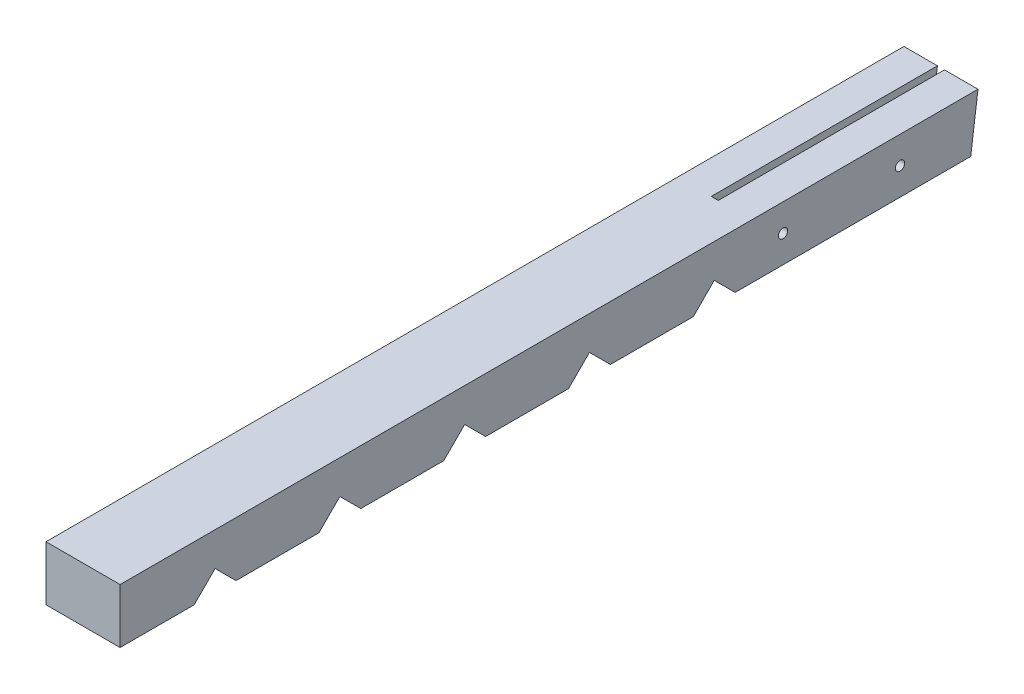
ISO-10303-21;
HEADER;
FILE_DESCRIPTION(('STEP AP214'),'2;1');
FILE_NAME('part.step','',(''),(''),'','','');
FILE_SCHEMA(('AUTOMOTIVE_DESIGN { 1 0 10303 214 1 1 1 1 }'));
ENDSEC;
DATA;
#1=APPLICATION_CONTEXT('core data for automotive mechanical design processes');
#2=APPLICATION_PROTOCOL_DEFINITION('international standard','automotive_design',2000,#1);
#3=PRODUCT_CONTEXT('',#1,'mechanical');
#4=PRODUCT('Part','Part','',(#3));
#5=PRODUCT_RELATED_PRODUCT_CATEGORY('part','',(#4));
#6=PRODUCT_DEFINITION_FORMATION('','',#4);
#7=PRODUCT_DEFINITION_CONTEXT('part definition',#1,'design');
#8=PRODUCT_DEFINITION('design','',#6,#7);
#9=PRODUCT_DEFINITION_SHAPE('','',#8);
#10=(LENGTH_UNIT() NAMED_UNIT(*) SI_UNIT(.MILLI.,.METRE.));
#11=(NAMED_UNIT(*) PLANE_ANGLE_UNIT() SI_UNIT($,.RADIAN.));
#12=(NAMED_UNIT(*) SI_UNIT($,.STERADIAN.) SOLID_ANGLE_UNIT());
#13=UNCERTAINTY_MEASURE_WITH_UNIT(LENGTH_MEASURE(1.E-05),#10,'distance_accuracy_value','');
#14=(GEOMETRIC_REPRESENTATION_CONTEXT(3) GLOBAL_UNCERTAINTY_ASSIGNED_CONTEXT((#13)) GLOBAL_UNIT_ASSIGNED_CONTEXT((#10,
#11,#12)) REPRESENTATION_CONTEXT('',''));
#15=CARTESIAN_POINT('',(0.,0.,0.));
#16=DIRECTION('',(0.,0.,1.));
#17=DIRECTION('',(1.,0.,0.));
#18=AXIS2_PLACEMENT_3D('',#15,#16,#17);
#19=CARTESIAN_POINT('',(-47.5,5.,1100.));
#20=DIRECTION('',(0.,1.,0.));
#21=DIRECTION('',(-1.,0.,0.));
#22=AXIS2_PLACEMENT_3D('',#19,#20,#21);
#23=PLANE('',#22);
#24=DIRECTION('',(0.,0.,-1.));
#25=VECTOR('',#24,1.);
#26=CARTESIAN_POINT('',(-47.5,5.,1100.));
#27=LINE('',#26,#25);
#28=CARTESIAN_POINT('',(-47.5,5.,311.360389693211));
#29=VERTEX_POINT('',#28);
#30=CARTESIAN_POINT('',(-47.5,5.,9.33333333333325));
#31=VERTEX_POINT('',#30);
#32=EDGE_CURVE('E362',#29,#31,#27,.T.);
#33=ORIENTED_EDGE('',*,*,#32,.T.);
#34=DIRECTION('',(1.,0.,0.));
#35=VECTOR('',#34,1.);
#36=CARTESIAN_POINT('',(-47.5,5.,9.33333333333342));
#37=LINE('',#36,#35);
#38=CARTESIAN_POINT('',(-4.5,4.99999999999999,9.33333333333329));
#39=VERTEX_POINT('',#38);
#40=EDGE_CURVE('E210',#31,#39,#37,.T.);
#41=ORIENTED_EDGE('',*,*,#40,.T.);
#42=DIRECTION('',(0.,0.,-1.));
#43=VECTOR('',#42,1.);
#44=CARTESIAN_POINT('',(-4.5,5.,1100.));
#45=LINE('',#44,#43);
#46=CARTESIAN_POINT('',(-4.5,5.,290.));
#47=VERTEX_POINT('',#46);
#48=EDGE_CURVE('E238',#47,#39,#45,.T.);
#49=ORIENTED_EDGE('',*,*,#48,.F.);
#50=DIRECTION('',(1.,0.,0.));
#51=VECTOR('',#50,1.);
#52=CARTESIAN_POINT('',(-47.5,5.,290.));
#53=LINE('',#52,#51);
#54=CARTESIAN_POINT('',(4.5,5.,290.));
#55=VERTEX_POINT('',#54);
#56=EDGE_CURVE('E240',#47,#55,#53,.T.);
#57=ORIENTED_EDGE('',*,*,#56,.T.);
#58=DIRECTION('',(0.,0.,1.));
#59=VECTOR('',#58,1.);
#60=CARTESIAN_POINT('',(4.5,5.,1100.));
#61=LINE('',#60,#59);
#62=CARTESIAN_POINT('',(4.5,5.00000000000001,9.33333333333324));
#63=VERTEX_POINT('',#62);
#64=EDGE_CURVE('E232',#63,#55,#61,.T.);
#65=ORIENTED_EDGE('',*,*,#64,.F.);
#66=CARTESIAN_POINT('',(47.5,5.00000000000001,9.33333333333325));
#67=VERTEX_POINT('',#66);
#68=EDGE_CURVE('E41',#63,#67,#37,.T.);
#69=ORIENTED_EDGE('',*,*,#68,.T.);
#70=DIRECTION('',(0.,0.,-1.));
#71=VECTOR('',#70,1.);
#72=CARTESIAN_POINT('',(47.5,5.00000000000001,1100.));
#73=LINE('',#72,#71);
#74=CARTESIAN_POINT('',(47.5,5.00000000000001,311.360389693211));
#75=VERTEX_POINT('',#74);
#76=EDGE_CURVE('E358',#75,#67,#73,.T.);
#77=ORIENTED_EDGE('',*,*,#76,.F.);
#78=DIRECTION('',(-1.,0.,0.));
#79=VECTOR('',#78,1.);
#80=CARTESIAN_POINT('',(47.501,5.00000000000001,311.360389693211));
#81=LINE('',#80,#79);
#82=EDGE_CURVE('E263',#75,#29,#81,.T.);
#83=ORIENTED_EDGE('',*,*,#82,.T.);
#84=EDGE_LOOP('',(#33,#41,#49,#57,#65,#69,#77,#83));
#85=FACE_BOUND('',#84,.T.);
#86=ADVANCED_FACE('F26',(#85),#23,.F.);
#87=CARTESIAN_POINT('',(47.5,75.,1100.));
#88=DIRECTION('',(0.,-1.,0.));
#89=DIRECTION('',(1.,0.,0.));
#90=AXIS2_PLACEMENT_3D('',#87,#88,#89);
#91=PLANE('',#90);
#92=DIRECTION('',(0.,0.,-1.));
#93=VECTOR('',#92,1.);
#94=CARTESIAN_POINT('',(-4.5,75.,290.));
#95=LINE('',#94,#93);
#96=CARTESIAN_POINT('',(-4.5,75.,290.));
#97=VERTEX_POINT('',#96);
#98=CARTESIAN_POINT('',(-4.5,75.,0.));
#99=VERTEX_POINT('',#98);
#100=EDGE_CURVE('E205',#97,#99,#95,.T.);
#101=ORIENTED_EDGE('',*,*,#100,.T.);
#102=DIRECTION('',(-1.,0.,0.));
#103=VECTOR('',#102,1.);
#104=CARTESIAN_POINT('',(47.5,75.,0.));
#105=LINE('',#104,#103);
#106=CARTESIAN_POINT('',(-47.5,75.,0.));
#107=VERTEX_POINT('',#106);
#108=EDGE_CURVE('E196',#99,#107,#105,.T.);
#109=ORIENTED_EDGE('',*,*,#108,.T.);
#110=DIRECTION('',(0.,0.,-1.));
#111=VECTOR('',#110,1.);
#112=CARTESIAN_POINT('',(-47.5,75.,1100.));
#113=LINE('',#112,#111);
#114=CARTESIAN_POINT('',(-47.5,75.,1100.));
#115=VERTEX_POINT('',#114);
#116=EDGE_CURVE('E367',#115,#107,#113,.T.);
#117=ORIENTED_EDGE('',*,*,#116,.F.);
#118=DIRECTION('',(-1.,0.,0.));
#119=VECTOR('',#118,1.);
#120=CARTESIAN_POINT('',(47.5,75.,1100.));
#121=LINE('',#120,#119);
#122=CARTESIAN_POINT('',(47.5,75.,1100.));
#123=VERTEX_POINT('',#122);
#124=EDGE_CURVE('E352',#123,#115,#121,.T.);
#125=ORIENTED_EDGE('',*,*,#124,.F.);
#126=DIRECTION('',(0.,0.,-1.));
#127=VECTOR('',#126,1.);
#128=CARTESIAN_POINT('',(47.5,75.,1100.));
#129=LINE('',#128,#127);
#130=CARTESIAN_POINT('',(47.5,75.,0.));
#131=VERTEX_POINT('',#130);
#132=EDGE_CURVE('E34',#123,#131,#129,.T.);
#133=ORIENTED_EDGE('',*,*,#132,.T.);
#134=CARTESIAN_POINT('',(4.49999999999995,75.,0.));
#135=VERTEX_POINT('',#134);
#136=EDGE_CURVE('E186',#131,#135,#105,.T.);
#137=ORIENTED_EDGE('',*,*,#136,.T.);
#138=DIRECTION('',(0.,0.,-1.));
#139=VECTOR('',#138,1.);
#140=CARTESIAN_POINT('',(4.5,75.,290.));
#141=LINE('',#140,#139);
#142=CARTESIAN_POINT('',(4.5,75.,290.));
#143=VERTEX_POINT('',#142);
#144=EDGE_CURVE('E191',#143,#135,#141,.T.);
#145=ORIENTED_EDGE('',*,*,#144,.F.);
#146=DIRECTION('',(-1.,0.,0.));
#147=VECTOR('',#146,1.);
#148=CARTESIAN_POINT('',(4.5,75.,290.));
#149=LINE('',#148,#147);
#150=EDGE_CURVE('E226',#143,#97,#149,.T.);
#151=ORIENTED_EDGE('',*,*,#150,.T.);
#152=EDGE_LOOP('',(#101,#109,#117,#125,#133,#137,#145,#151));
#153=FACE_BOUND('',#152,.T.);
#154=ADVANCED_FACE('F189',(#153),#91,.F.);
#155=CARTESIAN_POINT('',(47.5,40.,250.));
#156=DIRECTION('',(-1.,0.,0.));
#157=DIRECTION('',(0.,0.,1.));
#158=AXIS2_PLACEMENT_3D('',#155,#156,#157);
#159=CYLINDRICAL_SURFACE('',#158,6.00000000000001);
#160=CARTESIAN_POINT('',(-47.5,40.,250.));
#161=DIRECTION('',(1.,0.,0.));
#162=DIRECTION('',(0.,0.,-1.));
#163=AXIS2_PLACEMENT_3D('',#160,#161,#162);
#164=CIRCLE('',#163,6.00000000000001);
#165=CARTESIAN_POINT('',(-47.5,40.,256.));
#166=VERTEX_POINT('',#165);
#167=EDGE_CURVE('E249',#166,#166,#164,.T.);
#168=CARTESIAN_POINT('',(-4.5,40.,250.));
#169=DIRECTION('',(1.,0.,0.));
#170=DIRECTION('',(0.,0.,-1.));
#171=AXIS2_PLACEMENT_3D('',#168,#169,#170);
#172=CIRCLE('',#171,6.00000000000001);
#173=CARTESIAN_POINT('',(-4.5,40.,256.));
#174=VERTEX_POINT('',#173);
#175=EDGE_CURVE('E235',#174,#174,#172,.T.);
#176=CARTESIAN_POINT('',(-47.5,40.,256.));
#177=CARTESIAN_POINT('',(-47.0520833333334,40.,256.));
#178=CARTESIAN_POINT('',(-46.6041666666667,40.,256.));
#179=CARTESIAN_POINT('',(-45.7083333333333,40.,256.));
#180=CARTESIAN_POINT('',(-45.2604166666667,40.,256.));
#181=CARTESIAN_POINT('',(-44.3645833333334,40.,256.));
#182=CARTESIAN_POINT('',(-43.9166666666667,40.,256.));
#183=CARTESIAN_POINT('',(-43.0208333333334,40.,256.));
#184=CARTESIAN_POINT('',(-42.5729166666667,40.,256.));
#185=CARTESIAN_POINT('',(-41.6770833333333,40.,256.));
#186=CARTESIAN_POINT('',(-41.2291666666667,40.,256.));
#187=CARTESIAN_POINT('',(-40.3333333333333,40.,256.));
#188=CARTESIAN_POINT('',(-39.8854166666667,40.,256.));
#189=CARTESIAN_POINT('',(-38.9895833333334,40.,256.));
#190=CARTESIAN_POINT('',(-38.5416666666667,40.,256.));
#191=CARTESIAN_POINT('',(-37.6458333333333,40.,256.));
#192=CARTESIAN_POINT('',(-37.1979166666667,40.,256.));
#193=CARTESIAN_POINT('',(-36.3020833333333,40.,256.));
#194=CARTESIAN_POINT('',(-35.8541666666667,40.,256.));
#195=CARTESIAN_POINT('',(-34.9583333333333,40.,256.));
#196=CARTESIAN_POINT('',(-34.5104166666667,40.,256.));
#197=CARTESIAN_POINT('',(-33.6145833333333,40.,256.));
#198=CARTESIAN_POINT('',(-33.1666666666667,40.,256.));
#199=CARTESIAN_POINT('',(-32.2708333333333,40.,256.));
#200=CARTESIAN_POINT('',(-31.8229166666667,40.,256.));
#201=CARTESIAN_POINT('',(-30.9270833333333,40.,256.));
#202=CARTESIAN_POINT('',(-30.4791666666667,40.,256.));
#203=CARTESIAN_POINT('',(-29.5833333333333,40.,256.));
#204=CARTESIAN_POINT('',(-29.1354166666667,40.,256.));
#205=CARTESIAN_POINT('',(-28.2395833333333,40.,256.));
#206=CARTESIAN_POINT('',(-27.7916666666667,40.,256.));
#207=CARTESIAN_POINT('',(-26.8958333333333,40.,256.));
#208=CARTESIAN_POINT('',(-26.4479166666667,40.,256.));
#209=CARTESIAN_POINT('',(-25.5520833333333,40.,256.));
#210=CARTESIAN_POINT('',(-25.1041666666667,40.,256.));
#211=CARTESIAN_POINT('',(-24.2083333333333,40.,256.));
#212=CARTESIAN_POINT('',(-23.7604166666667,40.,256.));
#213=CARTESIAN_POINT('',(-22.8645833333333,40.,256.));
#214=CARTESIAN_POINT('',(-22.4166666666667,40.,256.));
#215=CARTESIAN_POINT('',(-21.5208333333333,40.,256.));
#216=CARTESIAN_POINT('',(-21.0729166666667,40.,256.));
#217=CARTESIAN_POINT('',(-20.1770833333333,40.,256.));
#218=CARTESIAN_POINT('',(-19.7291666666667,40.,256.));
#219=CARTESIAN_POINT('',(-18.8333333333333,40.,256.));
#220=CARTESIAN_POINT('',(-18.3854166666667,40.,256.));
#221=CARTESIAN_POINT('',(-17.4895833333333,40.,256.));
#222=CARTESIAN_POINT('',(-17.0416666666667,40.,256.));
#223=CARTESIAN_POINT('',(-16.1458333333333,40.,256.));
#224=CARTESIAN_POINT('',(-15.6979166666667,40.,256.));
#225=CARTESIAN_POINT('',(-14.8020833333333,40.,256.));
#226=CARTESIAN_POINT('',(-14.3541666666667,40.,256.));
#227=CARTESIAN_POINT('',(-13.4583333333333,40.,256.));
#228=CARTESIAN_POINT('',(-13.0104166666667,40.,256.));
#229=CARTESIAN_POINT('',(-12.1145833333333,40.,256.));
#230=CARTESIAN_POINT('',(-11.6666666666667,40.,256.));
#231=CARTESIAN_POINT('',(-10.7708333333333,40.,256.));
#232=CARTESIAN_POINT('',(-10.3229166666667,40.,256.));
#233=CARTESIAN_POINT('',(-9.42708333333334,40.,256.));
#234=CARTESIAN_POINT('',(-8.97916666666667,40.,256.));
#235=CARTESIAN_POINT('',(-8.08333333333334,40.,256.));
#236=CARTESIAN_POINT('',(-7.63541666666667,40.,256.));
#237=CARTESIAN_POINT('',(-6.73958333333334,40.,256.));
#238=CARTESIAN_POINT('',(-6.29166666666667,40.,256.));
#239=CARTESIAN_POINT('',(-5.39583333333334,40.,256.));
#240=CARTESIAN_POINT('',(-4.94791666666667,40.,256.));
#241=CARTESIAN_POINT('',(-4.5,40.,256.));
#242=B_SPLINE_CURVE_WITH_KNOTS('',3,(#176,#177,#178,#179,#180,#181,#182,#183,#184,#185,#186,
#187,#188,#189,#190,#191,#192,#193,#194,#195,#196,#197,#198,#199,#200,#201,#202,#203,#204,#205,
#206,#207,#208,#209,#210,#211,#212,#213,#214,#215,#216,#217,#218,#219,#220,#221,#222,#223,#224,
#225,#226,#227,#228,#229,#230,#231,#232,#233,#234,#235,#236,#237,#238,#239,#240,#241),
.UNSPECIFIED.,.F.,.F.,(4,2,2,2,2,2,2,2,2,2,2,2,2,2,2,2,2,2,2,2,2,2,2,2,2,2,2,2,2,2,2,2,4),(0.,
1.34375,2.6875,4.03125,5.375,6.71875000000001,8.0625,9.40625000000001,10.75,12.09375,13.4375,
14.78125,16.125,17.46875,18.8125,20.15625,21.5,22.84375,24.1875,25.53125,26.875,28.21875,
29.5625,30.90625,32.25,33.59375,34.9375,36.28125,37.625,38.96875,40.3125,41.65625,43.),.UNSPECIFIED.);
#243=EDGE_CURVE('BSEAM385',#166,#174,#242,.T.);
#244=ORIENTED_EDGE('',*,*,#167,.F.);
#245=ORIENTED_EDGE('',*,*,#175,.T.);
#246=ORIENTED_EDGE('',*,*,#243,.T.);
#247=ORIENTED_EDGE('',*,*,#243,.F.);
#248=EDGE_LOOP('',(#244,#246,#245,#247));
#249=FACE_BOUND('',#248,.T.);
#250=ADVANCED_FACE('F385',(#249),#159,.F.);
#251=CARTESIAN_POINT('',(47.5,40.,250.));
#252=DIRECTION('',(1.,0.,0.));
#253=DIRECTION('',(0.,0.,-1.));
#254=AXIS2_PLACEMENT_3D('',#251,#252,#253);
#255=CIRCLE('',#254,6.00000000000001);
#256=CARTESIAN_POINT('',(47.5,40.,256.));
#257=VERTEX_POINT('',#256);
#258=EDGE_CURVE('E252',#257,#257,#255,.T.);
#259=CARTESIAN_POINT('',(4.5,40.,250.));
#260=DIRECTION('',(-1.,0.,0.));
#261=DIRECTION('',(0.,0.,1.));
#262=AXIS2_PLACEMENT_3D('',#259,#260,#261);
#263=CIRCLE('',#262,6.00000000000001);
#264=CARTESIAN_POINT('',(4.5,40.,256.));
#265=VERTEX_POINT('',#264);
#266=EDGE_CURVE('E229',#265,#265,#263,.T.);
#267=CARTESIAN_POINT('',(47.5,40.,256.));
#268=CARTESIAN_POINT('',(47.0520833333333,40.,256.));
#269=CARTESIAN_POINT('',(46.6041666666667,40.,256.));
#270=CARTESIAN_POINT('',(45.7083333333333,40.,256.));
#271=CARTESIAN_POINT('',(45.2604166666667,40.,256.));
#272=CARTESIAN_POINT('',(44.3645833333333,40.,256.));
#273=CARTESIAN_POINT('',(43.9166666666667,40.,256.));
#274=CARTESIAN_POINT('',(43.0208333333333,40.,256.));
#275=CARTESIAN_POINT('',(42.5729166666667,40.,256.));
#276=CARTESIAN_POINT('',(41.6770833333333,40.,256.));
#277=CARTESIAN_POINT('',(41.2291666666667,40.,256.));
#278=CARTESIAN_POINT('',(40.3333333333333,40.,256.));
#279=CARTESIAN_POINT('',(39.8854166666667,40.,256.));
#280=CARTESIAN_POINT('',(38.9895833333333,40.,256.));
#281=CARTESIAN_POINT('',(38.5416666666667,40.,256.));
#282=CARTESIAN_POINT('',(37.6458333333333,40.,256.));
#283=CARTESIAN_POINT('',(37.1979166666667,40.,256.));
#284=CARTESIAN_POINT('',(36.3020833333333,40.,256.));
#285=CARTESIAN_POINT('',(35.8541666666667,40.,256.));
#286=CARTESIAN_POINT('',(34.9583333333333,40.,256.));
#287=CARTESIAN_POINT('',(34.5104166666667,40.,256.));
#288=CARTESIAN_POINT('',(33.6145833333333,40.,256.));
#289=CARTESIAN_POINT('',(33.1666666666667,40.,256.));
#290=CARTESIAN_POINT('',(32.2708333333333,40.,256.));
#291=CARTESIAN_POINT('',(31.8229166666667,40.,256.));
#292=CARTESIAN_POINT('',(30.9270833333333,40.,256.));
#293=CARTESIAN_POINT('',(30.4791666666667,40.,256.));
#294=CARTESIAN_POINT('',(29.5833333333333,40.,256.));
#295=CARTESIAN_POINT('',(29.1354166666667,40.,256.));
#296=CARTESIAN_POINT('',(28.2395833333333,40.,256.));
#297=CARTESIAN_POINT('',(27.7916666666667,40.,256.));
#298=CARTESIAN_POINT('',(26.8958333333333,40.,256.));
#299=CARTESIAN_POINT('',(26.4479166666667,40.,256.));
#300=CARTESIAN_POINT('',(25.5520833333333,40.,256.));
#301=CARTESIAN_POINT('',(25.1041666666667,40.,256.));
#302=CARTESIAN_POINT('',(24.2083333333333,40.,256.));
#303=CARTESIAN_POINT('',(23.7604166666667,40.,256.));
#304=CARTESIAN_POINT('',(22.8645833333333,40.,256.));
#305=CARTESIAN_POINT('',(22.4166666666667,40.,256.));
#306=CARTESIAN_POINT('',(21.5208333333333,40.,256.));
#307=CARTESIAN_POINT('',(21.0729166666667,40.,256.));
#308=CARTESIAN_POINT('',(20.1770833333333,40.,256.));
#309=CARTESIAN_POINT('',(19.7291666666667,40.,256.));
#310=CARTESIAN_POINT('',(18.8333333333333,40.,256.));
#311=CARTESIAN_POINT('',(18.3854166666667,40.,256.));
#312=CARTESIAN_POINT('',(17.4895833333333,40.,256.));
#313=CARTESIAN_POINT('',(17.0416666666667,40.,256.));
#314=CARTESIAN_POINT('',(16.1458333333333,40.,256.));
#315=CARTESIAN_POINT('',(15.6979166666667,40.,256.));
#316=CARTESIAN_POINT('',(14.8020833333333,40.,256.));
#317=CARTESIAN_POINT('',(14.3541666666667,40.,256.));
#318=CARTESIAN_POINT('',(13.4583333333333,40.,256.));
#319=CARTESIAN_POINT('',(13.0104166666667,40.,256.));
#320=CARTESIAN_POINT('',(12.1145833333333,40.,256.));
#321=CARTESIAN_POINT('',(11.6666666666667,40.,256.));
#322=CARTESIAN_POINT('',(10.7708333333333,40.,256.));
#323=CARTESIAN_POINT('',(10.3229166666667,40.,256.));
#324=CARTESIAN_POINT('',(9.42708333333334,40.,256.));
#325=CARTESIAN_POINT('',(8.97916666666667,40.,256.));
#326=CARTESIAN_POINT('',(8.08333333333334,40.,256.));
#327=CARTESIAN_POINT('',(7.63541666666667,40.,256.));
#328=CARTESIAN_POINT('',(6.73958333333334,40.,256.));
#329=CARTESIAN_POINT('',(6.29166666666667,40.,256.));
#330=CARTESIAN_POINT('',(5.39583333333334,40.,256.));
#331=CARTESIAN_POINT('',(4.94791666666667,40.,256.));
#332=CARTESIAN_POINT('',(4.5,40.,256.));
#333=B_SPLINE_CURVE_WITH_KNOTS('',3,(#267,#268,#269,#270,#271,#272,#273,#274,#275,#276,#277,
#278,#279,#280,#281,#282,#283,#284,#285,#286,#287,#288,#289,#290,#291,#292,#293,#294,#295,#296,
#297,#298,#299,#300,#301,#302,#303,#304,#305,#306,#307,#308,#309,#310,#311,#312,#313,#314,#315,
#316,#317,#318,#319,#320,#321,#322,#323,#324,#325,#326,#327,#328,#329,#330,#331,#332),
.UNSPECIFIED.,.F.,.F.,(4,2,2,2,2,2,2,2,2,2,2,2,2,2,2,2,2,2,2,2,2,2,2,2,2,2,2,2,2,2,2,2,4),(0.,
1.34375,2.6875,4.03124999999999,5.37499999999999,6.71875,8.06249999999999,9.40624999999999,
10.75,12.09375,13.4375,14.78125,16.125,17.46875,18.8125,20.15625,21.5,22.84375,24.1875,25.53125,
26.875,28.21875,29.5625,30.90625,32.25,33.59375,34.9375,36.28125,37.625,38.96875,40.3125,
41.65625,43.),.UNSPECIFIED.);
#334=EDGE_CURVE('BSEAM387',#257,#265,#333,.T.);
#335=ORIENTED_EDGE('',*,*,#258,.T.);
#336=ORIENTED_EDGE('',*,*,#266,.T.);
#337=ORIENTED_EDGE('',*,*,#334,.T.);
#338=ORIENTED_EDGE('',*,*,#334,.F.);
#339=EDGE_LOOP('',(#335,#337,#336,#338));
#340=FACE_BOUND('',#339,.T.);
#341=ADVANCED_FACE('F387',(#340),#159,.F.);
#342=CARTESIAN_POINT('',(47.5,40.,100.));
#343=DIRECTION('',(-1.,0.,0.));
#344=DIRECTION('',(0.,0.,1.));
#345=AXIS2_PLACEMENT_3D('',#342,#343,#344);
#346=CYLINDRICAL_SURFACE('',#345,6.00000000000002);
#347=CARTESIAN_POINT('',(-47.5,40.,100.));
#348=DIRECTION('',(1.,0.,0.));
#349=DIRECTION('',(0.,0.,-1.));
#350=AXIS2_PLACEMENT_3D('',#347,#348,#349);
#351=CIRCLE('',#350,6.00000000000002);
#352=CARTESIAN_POINT('',(-47.5,40.,106.));
#353=VERTEX_POINT('',#352);
#354=EDGE_CURVE('E243',#353,#353,#351,.T.);
#355=CARTESIAN_POINT('',(-4.5,40.,100.));
#356=DIRECTION('',(1.,0.,0.));
#357=DIRECTION('',(0.,0.,-1.));
#358=AXIS2_PLACEMENT_3D('',#355,#356,#357);
#359=CIRCLE('',#358,6.00000000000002);
#360=CARTESIAN_POINT('',(-4.5,40.,106.));
#361=VERTEX_POINT('',#360);
#362=EDGE_CURVE('E234',#361,#361,#359,.T.);
#363=CARTESIAN_POINT('',(-47.5,40.,106.));
#364=CARTESIAN_POINT('',(-47.0520833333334,40.,106.));
#365=CARTESIAN_POINT('',(-46.6041666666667,40.,106.));
#366=CARTESIAN_POINT('',(-45.7083333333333,40.,106.));
#367=CARTESIAN_POINT('',(-45.2604166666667,40.,106.));
#368=CARTESIAN_POINT('',(-44.3645833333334,40.,106.));
#369=CARTESIAN_POINT('',(-43.9166666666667,40.,106.));
#370=CARTESIAN_POINT('',(-43.0208333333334,40.,106.));
#371=CARTESIAN_POINT('',(-42.5729166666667,40.,106.));
#372=CARTESIAN_POINT('',(-41.6770833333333,40.,106.));
#373=CARTESIAN_POINT('',(-41.2291666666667,40.,106.));
#374=CARTESIAN_POINT('',(-40.3333333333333,40.,106.));
#375=CARTESIAN_POINT('',(-39.8854166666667,40.,106.));
#376=CARTESIAN_POINT('',(-38.9895833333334,40.,106.));
#377=CARTESIAN_POINT('',(-38.5416666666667,40.,106.));
#378=CARTESIAN_POINT('',(-37.6458333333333,40.,106.));
#379=CARTESIAN_POINT('',(-37.1979166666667,40.,106.));
#380=CARTESIAN_POINT('',(-36.3020833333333,40.,106.));
#381=CARTESIAN_POINT('',(-35.8541666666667,40.,106.));
#382=CARTESIAN_POINT('',(-34.9583333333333,40.,106.));
#383=CARTESIAN_POINT('',(-34.5104166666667,40.,106.));
#384=CARTESIAN_POINT('',(-33.6145833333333,40.,106.));
#385=CARTESIAN_POINT('',(-33.1666666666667,40.,106.));
#386=CARTESIAN_POINT('',(-32.2708333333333,40.,106.));
#387=CARTESIAN_POINT('',(-31.8229166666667,40.,106.));
#388=CARTESIAN_POINT('',(-30.9270833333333,40.,106.));
#389=CARTESIAN_POINT('',(-30.4791666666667,40.,106.));
#390=CARTESIAN_POINT('',(-29.5833333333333,40.,106.));
#391=CARTESIAN_POINT('',(-29.1354166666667,40.,106.));
#392=CARTESIAN_POINT('',(-28.2395833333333,40.,106.));
#393=CARTESIAN_POINT('',(-27.7916666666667,40.,106.));
#394=CARTESIAN_POINT('',(-26.8958333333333,40.,106.));
#395=CARTESIAN_POINT('',(-26.4479166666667,40.,106.));
#396=CARTESIAN_POINT('',(-25.5520833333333,40.,106.));
#397=CARTESIAN_POINT('',(-25.1041666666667,40.,106.));
#398=CARTESIAN_POINT('',(-24.2083333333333,40.,106.));
#399=CARTESIAN_POINT('',(-23.7604166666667,40.,106.));
#400=CARTESIAN_POINT('',(-22.8645833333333,40.,106.));
#401=CARTESIAN_POINT('',(-22.4166666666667,40.,106.));
#402=CARTESIAN_POINT('',(-21.5208333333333,40.,106.));
#403=CARTESIAN_POINT('',(-21.0729166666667,40.,106.));
#404=CARTESIAN_POINT('',(-20.1770833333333,40.,106.));
#405=CARTESIAN_POINT('',(-19.7291666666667,40.,106.));
#406=CARTESIAN_POINT('',(-18.8333333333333,40.,106.));
#407=CARTESIAN_POINT('',(-18.3854166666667,40.,106.));
#408=CARTESIAN_POINT('',(-17.4895833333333,40.,106.));
#409=CARTESIAN_POINT('',(-17.0416666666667,40.,106.));
#410=CARTESIAN_POINT('',(-16.1458333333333,40.,106.));
#411=CARTESIAN_POINT('',(-15.6979166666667,40.,106.));
#412=CARTESIAN_POINT('',(-14.8020833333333,40.,106.));
#413=CARTESIAN_POINT('',(-14.3541666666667,40.,106.));
#414=CARTESIAN_POINT('',(-13.4583333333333,40.,106.));
#415=CARTESIAN_POINT('',(-13.0104166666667,40.,106.));
#416=CARTESIAN_POINT('',(-12.1145833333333,40.,106.));
#417=CARTESIAN_POINT('',(-11.6666666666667,40.,106.));
#418=CARTESIAN_POINT('',(-10.7708333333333,40.,106.));
#419=CARTESIAN_POINT('',(-10.3229166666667,40.,106.));
#420=CARTESIAN_POINT('',(-9.42708333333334,40.,106.));
#421=CARTESIAN_POINT('',(-8.97916666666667,40.,106.));
#422=CARTESIAN_POINT('',(-8.08333333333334,40.,106.));
#423=CARTESIAN_POINT('',(-7.63541666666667,40.,106.));
#424=CARTESIAN_POINT('',(-6.73958333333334,40.,106.));
#425=CARTESIAN_POINT('',(-6.29166666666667,40.,106.));
#426=CARTESIAN_POINT('',(-5.39583333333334,40.,106.));
#427=CARTESIAN_POINT('',(-4.94791666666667,40.,106.));
#428=CARTESIAN_POINT('',(-4.5,40.,106.));
#429=B_SPLINE_CURVE_WITH_KNOTS('',3,(#363,#364,#365,#366,#367,#368,#369,#370,#371,#372,#373,
#374,#375,#376,#377,#378,#379,#380,#381,#382,#383,#384,#385,#386,#387,#388,#389,#390,#391,#392,
#393,#394,#395,#396,#397,#398,#399,#400,#401,#402,#403,#404,#405,#406,#407,#408,#409,#410,#411,
#412,#413,#414,#415,#416,#417,#418,#419,#420,#421,#422,#423,#424,#425,#426,#427,#428),
.UNSPECIFIED.,.F.,.F.,(4,2,2,2,2,2,2,2,2,2,2,2,2,2,2,2,2,2,2,2,2,2,2,2,2,2,2,2,2,2,2,2,4),(0.,
1.34375,2.6875,4.03125,5.375,6.71875000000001,8.0625,9.40625000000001,10.75,12.09375,13.4375,
14.78125,16.125,17.46875,18.8125,20.15625,21.5,22.84375,24.1875,25.53125,26.875,28.21875,
29.5625,30.90625,32.25,33.59375,34.9375,36.28125,37.625,38.96875,40.3125,41.65625,43.),.UNSPECIFIED.);
#430=EDGE_CURVE('BSEAM375',#353,#361,#429,.T.);
#431=ORIENTED_EDGE('',*,*,#354,.F.);
#432=ORIENTED_EDGE('',*,*,#362,.T.);
#433=ORIENTED_EDGE('',*,*,#430,.T.);
#434=ORIENTED_EDGE('',*,*,#430,.F.);
#435=EDGE_LOOP('',(#431,#433,#432,#434));
#436=FACE_BOUND('',#435,.T.);
#437=ADVANCED_FACE('F375',(#436),#346,.F.);
#438=CARTESIAN_POINT('',(47.5,40.,100.));
#439=DIRECTION('',(1.,0.,0.));
#440=DIRECTION('',(0.,0.,-1.));
#441=AXIS2_PLACEMENT_3D('',#438,#439,#440);
#442=CIRCLE('',#441,6.00000000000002);
#443=CARTESIAN_POINT('',(47.5,40.,106.));
#444=VERTEX_POINT('',#443);
#445=EDGE_CURVE('E246',#444,#444,#442,.T.);
#446=CARTESIAN_POINT('',(4.5,40.,100.));
#447=DIRECTION('',(-1.,0.,0.));
#448=DIRECTION('',(0.,0.,1.));
#449=AXIS2_PLACEMENT_3D('',#446,#447,#448);
#450=CIRCLE('',#449,6.00000000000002);
#451=CARTESIAN_POINT('',(4.5,40.,106.));
#452=VERTEX_POINT('',#451);
#453=EDGE_CURVE('E204',#452,#452,#450,.T.);
#454=CARTESIAN_POINT('',(47.5,40.,106.));
#455=CARTESIAN_POINT('',(47.0520833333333,40.,106.));
#456=CARTESIAN_POINT('',(46.6041666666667,40.,106.));
#457=CARTESIAN_POINT('',(45.7083333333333,40.,106.));
#458=CARTESIAN_POINT('',(45.2604166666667,40.,106.));
#459=CARTESIAN_POINT('',(44.3645833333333,40.,106.));
#460=CARTESIAN_POINT('',(43.9166666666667,40.,106.));
#461=CARTESIAN_POINT('',(43.0208333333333,40.,106.));
#462=CARTESIAN_POINT('',(42.5729166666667,40.,106.));
#463=CARTESIAN_POINT('',(41.6770833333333,40.,106.));
#464=CARTESIAN_POINT('',(41.2291666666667,40.,106.));
#465=CARTESIAN_POINT('',(40.3333333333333,40.,106.));
#466=CARTESIAN_POINT('',(39.8854166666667,40.,106.));
#467=CARTESIAN_POINT('',(38.9895833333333,40.,106.));
#468=CARTESIAN_POINT('',(38.5416666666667,40.,106.));
#469=CARTESIAN_POINT('',(37.6458333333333,40.,106.));
#470=CARTESIAN_POINT('',(37.1979166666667,40.,106.));
#471=CARTESIAN_POINT('',(36.3020833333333,40.,106.));
#472=CARTESIAN_POINT('',(35.8541666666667,40.,106.));
#473=CARTESIAN_POINT('',(34.9583333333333,40.,106.));
#474=CARTESIAN_POINT('',(34.5104166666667,40.,106.));
#475=CARTESIAN_POINT('',(33.6145833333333,40.,106.));
#476=CARTESIAN_POINT('',(33.1666666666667,40.,106.));
#477=CARTESIAN_POINT('',(32.2708333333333,40.,106.));
#478=CARTESIAN_POINT('',(31.8229166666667,40.,106.));
#479=CARTESIAN_POINT('',(30.9270833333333,40.,106.));
#480=CARTESIAN_POINT('',(30.4791666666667,40.,106.));
#481=CARTESIAN_POINT('',(29.5833333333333,40.,106.));
#482=CARTESIAN_POINT('',(29.1354166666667,40.,106.));
#483=CARTESIAN_POINT('',(28.2395833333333,40.,106.));
#484=CARTESIAN_POINT('',(27.7916666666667,40.,106.));
#485=CARTESIAN_POINT('',(26.8958333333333,40.,106.));
#486=CARTESIAN_POINT('',(26.4479166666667,40.,106.));
#487=CARTESIAN_POINT('',(25.5520833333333,40.,106.));
#488=CARTESIAN_POINT('',(25.1041666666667,40.,106.));
#489=CARTESIAN_POINT('',(24.2083333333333,40.,106.));
#490=CARTESIAN_POINT('',(23.7604166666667,40.,106.));
#491=CARTESIAN_POINT('',(22.8645833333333,40.,106.));
#492=CARTESIAN_POINT('',(22.4166666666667,40.,106.));
#493=CARTESIAN_POINT('',(21.5208333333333,40.,106.));
#494=CARTESIAN_POINT('',(21.0729166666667,40.,106.));
#495=CARTESIAN_POINT('',(20.1770833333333,40.,106.));
#496=CARTESIAN_POINT('',(19.7291666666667,40.,106.));
#497=CARTESIAN_POINT('',(18.8333333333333,40.,106.));
#498=CARTESIAN_POINT('',(18.3854166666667,40.,106.));
#499=CARTESIAN_POINT('',(17.4895833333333,40.,106.));
#500=CARTESIAN_POINT('',(17.0416666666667,40.,106.));
#501=CARTESIAN_POINT('',(16.1458333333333,40.,106.));
#502=CARTESIAN_POINT('',(15.6979166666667,40.,106.));
#503=CARTESIAN_POINT('',(14.8020833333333,40.,106.));
#504=CARTESIAN_POINT('',(14.3541666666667,40.,106.));
#505=CARTESIAN_POINT('',(13.4583333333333,40.,106.));
#506=CARTESIAN_POINT('',(13.0104166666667,40.,106.));
#507=CARTESIAN_POINT('',(12.1145833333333,40.,106.));
#508=CARTESIAN_POINT('',(11.6666666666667,40.,106.));
#509=CARTESIAN_POINT('',(10.7708333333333,40.,106.));
#510=CARTESIAN_POINT('',(10.3229166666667,40.,106.));
#511=CARTESIAN_POINT('',(9.42708333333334,40.,106.));
#512=CARTESIAN_POINT('',(8.97916666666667,40.,106.));
#513=CARTESIAN_POINT('',(8.08333333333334,40.,106.));
#514=CARTESIAN_POINT('',(7.63541666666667,40.,106.));
#515=CARTESIAN_POINT('',(6.73958333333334,40.,106.));
#516=CARTESIAN_POINT('',(6.29166666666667,40.,106.));
#517=CARTESIAN_POINT('',(5.39583333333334,40.,106.));
#518=CARTESIAN_POINT('',(4.94791666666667,40.,106.));
#519=CARTESIAN_POINT('',(4.5,40.,106.));
#520=B_SPLINE_CURVE_WITH_KNOTS('',3,(#454,#455,#456,#457,#458,#459,#460,#461,#462,#463,#464,
#465,#466,#467,#468,#469,#470,#471,#472,#473,#474,#475,#476,#477,#478,#479,#480,#481,#482,#483,
#484,#485,#486,#487,#488,#489,#490,#491,#492,#493,#494,#495,#496,#497,#498,#499,#500,#501,#502,
#503,#504,#505,#506,#507,#508,#509,#510,#511,#512,#513,#514,#515,#516,#517,#518,#519),
.UNSPECIFIED.,.F.,.F.,(4,2,2,2,2,2,2,2,2,2,2,2,2,2,2,2,2,2,2,2,2,2,2,2,2,2,2,2,2,2,2,2,4),(0.,
1.34375,2.6875,4.03124999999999,5.37499999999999,6.71875,8.06249999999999,9.40624999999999,
10.75,12.09375,13.4375,14.78125,16.125,17.46875,18.8125,20.15625,21.5,22.84375,24.1875,25.53125,
26.875,28.21875,29.5625,30.90625,32.25,33.59375,34.9375,36.28125,37.625,38.96875,40.3125,
41.65625,43.),.UNSPECIFIED.);
#521=EDGE_CURVE('BSEAM578',#444,#452,#520,.T.);
#522=ORIENTED_EDGE('',*,*,#445,.T.);
#523=ORIENTED_EDGE('',*,*,#453,.T.);
#524=ORIENTED_EDGE('',*,*,#521,.T.);
#525=ORIENTED_EDGE('',*,*,#521,.F.);
#526=EDGE_LOOP('',(#522,#524,#523,#525));
#527=FACE_BOUND('',#526,.T.);
#528=ADVANCED_FACE('F578',(#527),#346,.F.);
#529=CARTESIAN_POINT('',(47.5,75.,1100.));
#530=DIRECTION('',(-1.,0.,0.));
#531=DIRECTION('',(0.,0.,1.));
#532=AXIS2_PLACEMENT_3D('',#529,#530,#531);
#533=PLANE('',#532);
#534=ORIENTED_EDGE('',*,*,#258,.F.);
#535=EDGE_LOOP('',(#534));
#536=FACE_BOUND('',#535,.T.);
#537=ORIENTED_EDGE('',*,*,#76,.T.);
#538=DIRECTION('',(0.,0.991227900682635,-0.132163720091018));
#539=VECTOR('',#538,1.);
#540=CARTESIAN_POINT('',(47.5,-69.1048034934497,19.2139737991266));
#541=LINE('',#540,#539);
#542=EDGE_CURVE('E208',#67,#131,#541,.T.);
#543=ORIENTED_EDGE('',*,*,#542,.T.);
#544=ORIENTED_EDGE('',*,*,#132,.F.);
#545=DIRECTION('',(0.,1.,0.));
#546=VECTOR('',#545,1.);
#547=CARTESIAN_POINT('',(47.5,75.,1100.));
#548=LINE('',#547,#546);
#549=CARTESIAN_POINT('',(47.5,5.00000000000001,1100.));
#550=VERTEX_POINT('',#549);
#551=EDGE_CURVE('E195',#550,#123,#548,.T.);
#552=ORIENTED_EDGE('',*,*,#551,.F.);
#553=CARTESIAN_POINT('',(47.5,5.00000000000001,1005.));
#554=VERTEX_POINT('',#553);
#555=EDGE_CURVE('E359',#550,#554,#73,.T.);
#556=ORIENTED_EDGE('',*,*,#555,.T.);
#557=DIRECTION('',(0.,0.707106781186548,-0.707106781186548));
#558=VECTOR('',#557,1.);
#559=CARTESIAN_POINT('',(47.5,31.8198051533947,978.180194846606));
#560=LINE('',#559,#558);
#561=CARTESIAN_POINT('',(47.5,31.8198051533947,978.180194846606));
#562=VERTEX_POINT('',#561);
#563=EDGE_CURVE('E347',#554,#562,#560,.T.);
#564=ORIENTED_EDGE('',*,*,#563,.T.);
#565=DIRECTION('',(0.,-0.707106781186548,-0.707106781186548));
#566=VECTOR('',#565,1.);
#567=CARTESIAN_POINT('',(47.5,0.,946.360389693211));
#568=LINE('',#567,#566);
#569=CARTESIAN_POINT('',(47.5,5.00000000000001,951.360389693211));
#570=VERTEX_POINT('',#569);
#571=EDGE_CURVE('E342',#562,#570,#568,.T.);
#572=ORIENTED_EDGE('',*,*,#571,.T.);
#573=CARTESIAN_POINT('',(47.5,5.00000000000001,845.));
#574=VERTEX_POINT('',#573);
#575=EDGE_CURVE('E363',#570,#574,#73,.T.);
#576=ORIENTED_EDGE('',*,*,#575,.T.);
#577=DIRECTION('',(0.,0.707106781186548,-0.707106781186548));
#578=VECTOR('',#577,1.);
#579=CARTESIAN_POINT('',(47.5,31.8198051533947,818.180194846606));
#580=LINE('',#579,#578);
#581=CARTESIAN_POINT('',(47.5,31.8198051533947,818.180194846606));
#582=VERTEX_POINT('',#581);
#583=EDGE_CURVE('E328',#574,#582,#580,.T.);
#584=ORIENTED_EDGE('',*,*,#583,.T.);
#585=DIRECTION('',(0.,-0.707106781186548,-0.707106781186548));
#586=VECTOR('',#585,1.);
#587=CARTESIAN_POINT('',(47.5,0.,786.360389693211));
#588=LINE('',#587,#586);
#589=CARTESIAN_POINT('',(47.5,5.00000000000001,791.360389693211));
#590=VERTEX_POINT('',#589);
#591=EDGE_CURVE('E323',#582,#590,#588,.T.);
#592=ORIENTED_EDGE('',*,*,#591,.T.);
#593=CARTESIAN_POINT('',(47.5,5.00000000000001,685.));
#594=VERTEX_POINT('',#593);
#595=EDGE_CURVE('E444',#590,#594,#73,.T.);
#596=ORIENTED_EDGE('',*,*,#595,.T.);
#597=DIRECTION('',(0.,0.707106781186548,-0.707106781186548));
#598=VECTOR('',#597,1.);
#599=CARTESIAN_POINT('',(47.5,31.8198051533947,658.180194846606));
#600=LINE('',#599,#598);
#601=CARTESIAN_POINT('',(47.5,31.8198051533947,658.180194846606));
#602=VERTEX_POINT('',#601);
#603=EDGE_CURVE('E309',#594,#602,#600,.T.);
#604=ORIENTED_EDGE('',*,*,#603,.T.);
#605=DIRECTION('',(0.,-0.707106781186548,-0.707106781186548));
#606=VECTOR('',#605,1.);
#607=CARTESIAN_POINT('',(47.5,0.,626.360389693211));
#608=LINE('',#607,#606);
#609=CARTESIAN_POINT('',(47.5,5.00000000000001,631.360389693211));
#610=VERTEX_POINT('',#609);
#611=EDGE_CURVE('E304',#602,#610,#608,.T.);
#612=ORIENTED_EDGE('',*,*,#611,.T.);
#613=CARTESIAN_POINT('',(47.5,5.00000000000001,525.));
#614=VERTEX_POINT('',#613);
#615=EDGE_CURVE('E446',#610,#614,#73,.T.);
#616=ORIENTED_EDGE('',*,*,#615,.T.);
#617=DIRECTION('',(0.,0.707106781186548,-0.707106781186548));
#618=VECTOR('',#617,1.);
#619=CARTESIAN_POINT('',(47.5,31.8198051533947,498.180194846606));
#620=LINE('',#619,#618);
#621=CARTESIAN_POINT('',(47.5,31.8198051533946,498.180194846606));
#622=VERTEX_POINT('',#621);
#623=EDGE_CURVE('E290',#614,#622,#620,.T.);
#624=ORIENTED_EDGE('',*,*,#623,.T.);
#625=DIRECTION('',(0.,-0.707106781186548,-0.707106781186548));
#626=VECTOR('',#625,1.);
#627=CARTESIAN_POINT('',(47.5,0.,466.360389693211));
#628=LINE('',#627,#626);
#629=CARTESIAN_POINT('',(47.5,5.00000000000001,471.360389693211));
#630=VERTEX_POINT('',#629);
#631=EDGE_CURVE('E285',#622,#630,#628,.T.);
#632=ORIENTED_EDGE('',*,*,#631,.T.);
#633=CARTESIAN_POINT('',(47.5,5.00000000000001,365.));
#634=VERTEX_POINT('',#633);
#635=EDGE_CURVE('E449',#630,#634,#73,.T.);
#636=ORIENTED_EDGE('',*,*,#635,.T.);
#637=DIRECTION('',(0.,0.707106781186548,-0.707106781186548));
#638=VECTOR('',#637,1.);
#639=CARTESIAN_POINT('',(47.5,31.8198051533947,338.180194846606));
#640=LINE('',#639,#638);
#641=CARTESIAN_POINT('',(47.5,31.8198051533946,338.180194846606));
#642=VERTEX_POINT('',#641);
#643=EDGE_CURVE('E271',#634,#642,#640,.T.);
#644=ORIENTED_EDGE('',*,*,#643,.T.);
#645=DIRECTION('',(0.,-0.707106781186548,-0.707106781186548));
#646=VECTOR('',#645,1.);
#647=CARTESIAN_POINT('',(47.5,0.,306.360389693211));
#648=LINE('',#647,#646);
#649=EDGE_CURVE('E266',#642,#75,#648,.T.);
#650=ORIENTED_EDGE('',*,*,#649,.T.);
#651=EDGE_LOOP('',(#537,#543,#544,#552,#556,#564,#572,#576,#584,#592,#596,#604,#612,#616,#624,
#632,#636,#644,#650));
#652=FACE_BOUND('',#651,.T.);
#653=ORIENTED_EDGE('',*,*,#445,.F.);
#654=EDGE_LOOP('',(#653));
#655=FACE_BOUND('',#654,.T.);
#656=ADVANCED_FACE('F28',(#536,#652,#655),#533,.F.);
#657=CARTESIAN_POINT('',(-47.5,75.,1100.));
#658=DIRECTION('',(1.,0.,0.));
#659=DIRECTION('',(0.,1.,0.));
#660=AXIS2_PLACEMENT_3D('',#657,#658,#659);
#661=PLANE('',#660);
#662=ORIENTED_EDGE('',*,*,#167,.T.);
#663=EDGE_LOOP('',(#662));
#664=FACE_BOUND('',#663,.T.);
#665=ORIENTED_EDGE('',*,*,#116,.T.);
#666=DIRECTION('',(0.,-0.991227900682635,0.132163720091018));
#667=VECTOR('',#666,1.);
#668=CARTESIAN_POINT('',(-47.5,-69.1048034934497,19.2139737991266));
#669=LINE('',#668,#667);
#670=EDGE_CURVE('E49',#107,#31,#669,.T.);
#671=ORIENTED_EDGE('',*,*,#670,.T.);
#672=ORIENTED_EDGE('',*,*,#32,.F.);
#673=DIRECTION('',(0.,-0.707106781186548,-0.707106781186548));
#674=VECTOR('',#673,1.);
#675=CARTESIAN_POINT('',(-47.5,0.,306.360389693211));
#676=LINE('',#675,#674);
#677=CARTESIAN_POINT('',(-47.5,31.8198051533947,338.180194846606));
#678=VERTEX_POINT('',#677);
#679=EDGE_CURVE('E255',#678,#29,#676,.T.);
#680=ORIENTED_EDGE('',*,*,#679,.F.);
#681=DIRECTION('',(0.,0.707106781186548,-0.707106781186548));
#682=VECTOR('',#681,1.);
#683=CARTESIAN_POINT('',(-47.5,31.8198051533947,338.180194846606));
#684=LINE('',#683,#682);
#685=CARTESIAN_POINT('',(-47.5,4.99999999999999,365.));
#686=VERTEX_POINT('',#685);
#687=EDGE_CURVE('E257',#686,#678,#684,.T.);
#688=ORIENTED_EDGE('',*,*,#687,.F.);
#689=CARTESIAN_POINT('',(-47.5,5.,471.360389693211));
#690=VERTEX_POINT('',#689);
#691=EDGE_CURVE('E456',#690,#686,#27,.T.);
#692=ORIENTED_EDGE('',*,*,#691,.F.);
#693=DIRECTION('',(0.,-0.707106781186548,-0.707106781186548));
#694=VECTOR('',#693,1.);
#695=CARTESIAN_POINT('',(-47.5,0.,466.360389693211));
#696=LINE('',#695,#694);
#697=CARTESIAN_POINT('',(-47.5,31.8198051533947,498.180194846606));
#698=VERTEX_POINT('',#697);
#699=EDGE_CURVE('E274',#698,#690,#696,.T.);
#700=ORIENTED_EDGE('',*,*,#699,.F.);
#701=DIRECTION('',(0.,0.707106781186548,-0.707106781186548));
#702=VECTOR('',#701,1.);
#703=CARTESIAN_POINT('',(-47.5,31.8198051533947,498.180194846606));
#704=LINE('',#703,#702);
#705=CARTESIAN_POINT('',(-47.5,4.99999999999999,525.));
#706=VERTEX_POINT('',#705);
#707=EDGE_CURVE('E276',#706,#698,#704,.T.);
#708=ORIENTED_EDGE('',*,*,#707,.F.);
#709=CARTESIAN_POINT('',(-47.5,5.,631.360389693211));
#710=VERTEX_POINT('',#709);
#711=EDGE_CURVE('E458',#710,#706,#27,.T.);
#712=ORIENTED_EDGE('',*,*,#711,.F.);
#713=DIRECTION('',(0.,-0.707106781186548,-0.707106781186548));
#714=VECTOR('',#713,1.);
#715=CARTESIAN_POINT('',(-47.5,0.,626.360389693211));
#716=LINE('',#715,#714);
#717=CARTESIAN_POINT('',(-47.5,31.8198051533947,658.180194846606));
#718=VERTEX_POINT('',#717);
#719=EDGE_CURVE('E293',#718,#710,#716,.T.);
#720=ORIENTED_EDGE('',*,*,#719,.F.);
#721=DIRECTION('',(0.,0.707106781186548,-0.707106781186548));
#722=VECTOR('',#721,1.);
#723=CARTESIAN_POINT('',(-47.5,31.8198051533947,658.180194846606));
#724=LINE('',#723,#722);
#725=CARTESIAN_POINT('',(-47.5,4.99999999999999,685.));
#726=VERTEX_POINT('',#725);
#727=EDGE_CURVE('E295',#726,#718,#724,.T.);
#728=ORIENTED_EDGE('',*,*,#727,.F.);
#729=CARTESIAN_POINT('',(-47.5,5.,791.360389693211));
#730=VERTEX_POINT('',#729);
#731=EDGE_CURVE('E461',#730,#726,#27,.T.);
#732=ORIENTED_EDGE('',*,*,#731,.F.);
#733=DIRECTION('',(0.,-0.707106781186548,-0.707106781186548));
#734=VECTOR('',#733,1.);
#735=CARTESIAN_POINT('',(-47.5,0.,786.360389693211));
#736=LINE('',#735,#734);
#737=CARTESIAN_POINT('',(-47.5,31.8198051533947,818.180194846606));
#738=VERTEX_POINT('',#737);
#739=EDGE_CURVE('E312',#738,#730,#736,.T.);
#740=ORIENTED_EDGE('',*,*,#739,.F.);
#741=DIRECTION('',(0.,0.707106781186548,-0.707106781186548));
#742=VECTOR('',#741,1.);
#743=CARTESIAN_POINT('',(-47.5,31.8198051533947,818.180194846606));
#744=LINE('',#743,#742);
#745=CARTESIAN_POINT('',(-47.5,4.99999999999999,845.));
#746=VERTEX_POINT('',#745);
#747=EDGE_CURVE('E314',#746,#738,#744,.T.);
#748=ORIENTED_EDGE('',*,*,#747,.F.);
#749=CARTESIAN_POINT('',(-47.5,5.,951.360389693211));
#750=VERTEX_POINT('',#749);
#751=EDGE_CURVE('E368',#750,#746,#27,.T.);
#752=ORIENTED_EDGE('',*,*,#751,.F.);
#753=DIRECTION('',(0.,-0.707106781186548,-0.707106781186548));
#754=VECTOR('',#753,1.);
#755=CARTESIAN_POINT('',(-47.5,0.,946.360389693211));
#756=LINE('',#755,#754);
#757=CARTESIAN_POINT('',(-47.5,31.8198051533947,978.180194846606));
#758=VERTEX_POINT('',#757);
#759=EDGE_CURVE('E331',#758,#750,#756,.T.);
#760=ORIENTED_EDGE('',*,*,#759,.F.);
#761=DIRECTION('',(0.,0.707106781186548,-0.707106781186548));
#762=VECTOR('',#761,1.);
#763=CARTESIAN_POINT('',(-47.5,31.8198051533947,978.180194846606));
#764=LINE('',#763,#762);
#765=CARTESIAN_POINT('',(-47.5,4.99999999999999,1005.));
#766=VERTEX_POINT('',#765);
#767=EDGE_CURVE('E333',#766,#758,#764,.T.);
#768=ORIENTED_EDGE('',*,*,#767,.F.);
#769=CARTESIAN_POINT('',(-47.5,5.,1100.));
#770=VERTEX_POINT('',#769);
#771=EDGE_CURVE('E364',#770,#766,#27,.T.);
#772=ORIENTED_EDGE('',*,*,#771,.F.);
#773=DIRECTION('',(0.,-1.,0.));
#774=VECTOR('',#773,1.);
#775=CARTESIAN_POINT('',(-47.5,75.,1100.));
#776=LINE('',#775,#774);
#777=EDGE_CURVE('E354',#115,#770,#776,.T.);
#778=ORIENTED_EDGE('',*,*,#777,.F.);
#779=EDGE_LOOP('',(#665,#671,#672,#680,#688,#692,#700,#708,#712,#720,#728,#732,#740,#748,#752,
#760,#768,#772,#778));
#780=FACE_BOUND('',#779,.T.);
#781=ORIENTED_EDGE('',*,*,#354,.T.);
#782=EDGE_LOOP('',(#781));
#783=FACE_BOUND('',#782,.T.);
#784=ADVANCED_FACE('F410',(#664,#780,#783),#661,.F.);
#785=DIRECTION('',(1.,0.,0.));
#786=VECTOR('',#785,1.);
#787=CARTESIAN_POINT('',(47.501,5.,365.));
#788=LINE('',#787,#786);
#789=EDGE_CURVE('E260',#686,#634,#788,.T.);
#790=ORIENTED_EDGE('',*,*,#789,.T.);
#791=ORIENTED_EDGE('',*,*,#635,.F.);
#792=DIRECTION('',(-1.,0.,0.));
#793=VECTOR('',#792,1.);
#794=CARTESIAN_POINT('',(47.501,5.00000000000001,471.360389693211));
#795=LINE('',#794,#793);
#796=EDGE_CURVE('E282',#630,#690,#795,.T.);
#797=ORIENTED_EDGE('',*,*,#796,.T.);
#798=ORIENTED_EDGE('',*,*,#691,.T.);
#799=EDGE_LOOP('',(#790,#791,#797,#798));
#800=FACE_BOUND('',#799,.T.);
#801=ADVANCED_FACE('F401',(#800),#23,.F.);
#802=DIRECTION('',(1.,0.,0.));
#803=VECTOR('',#802,1.);
#804=CARTESIAN_POINT('',(47.501,5.,525.));
#805=LINE('',#804,#803);
#806=EDGE_CURVE('E279',#706,#614,#805,.T.);
#807=ORIENTED_EDGE('',*,*,#806,.T.);
#808=ORIENTED_EDGE('',*,*,#615,.F.);
#809=DIRECTION('',(-1.,0.,0.));
#810=VECTOR('',#809,1.);
#811=CARTESIAN_POINT('',(47.501,5.00000000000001,631.360389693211));
#812=LINE('',#811,#810);
#813=EDGE_CURVE('E301',#610,#710,#812,.T.);
#814=ORIENTED_EDGE('',*,*,#813,.T.);
#815=ORIENTED_EDGE('',*,*,#711,.T.);
#816=EDGE_LOOP('',(#807,#808,#814,#815));
#817=FACE_BOUND('',#816,.T.);
#818=ADVANCED_FACE('F409',(#817),#23,.F.);
#819=DIRECTION('',(1.,0.,0.));
#820=VECTOR('',#819,1.);
#821=CARTESIAN_POINT('',(47.501,5.,685.));
#822=LINE('',#821,#820);
#823=EDGE_CURVE('E298',#726,#594,#822,.T.);
#824=ORIENTED_EDGE('',*,*,#823,.T.);
#825=ORIENTED_EDGE('',*,*,#595,.F.);
#826=DIRECTION('',(-1.,0.,0.));
#827=VECTOR('',#826,1.);
#828=CARTESIAN_POINT('',(47.501,5.00000000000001,791.360389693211));
#829=LINE('',#828,#827);
#830=EDGE_CURVE('E320',#590,#730,#829,.T.);
#831=ORIENTED_EDGE('',*,*,#830,.T.);
#832=ORIENTED_EDGE('',*,*,#731,.T.);
#833=EDGE_LOOP('',(#824,#825,#831,#832));
#834=FACE_BOUND('',#833,.T.);
#835=ADVANCED_FACE('F423',(#834),#23,.F.);
#836=DIRECTION('',(1.,0.,0.));
#837=VECTOR('',#836,1.);
#838=CARTESIAN_POINT('',(47.501,5.,845.));
#839=LINE('',#838,#837);
#840=EDGE_CURVE('E317',#746,#574,#839,.T.);
#841=ORIENTED_EDGE('',*,*,#840,.T.);
#842=ORIENTED_EDGE('',*,*,#575,.F.);
#843=DIRECTION('',(-1.,0.,0.));
#844=VECTOR('',#843,1.);
#845=CARTESIAN_POINT('',(47.501,5.00000000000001,951.360389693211));
#846=LINE('',#845,#844);
#847=EDGE_CURVE('E339',#570,#750,#846,.T.);
#848=ORIENTED_EDGE('',*,*,#847,.T.);
#849=ORIENTED_EDGE('',*,*,#751,.T.);
#850=EDGE_LOOP('',(#841,#842,#848,#849));
#851=FACE_BOUND('',#850,.T.);
#852=ADVANCED_FACE('F414',(#851),#23,.F.);
#853=DIRECTION('',(1.,0.,0.));
#854=VECTOR('',#853,1.);
#855=CARTESIAN_POINT('',(47.501,5.,1005.));
#856=LINE('',#855,#854);
#857=EDGE_CURVE('E336',#766,#554,#856,.T.);
#858=ORIENTED_EDGE('',*,*,#857,.T.);
#859=ORIENTED_EDGE('',*,*,#555,.F.);
#860=DIRECTION('',(1.,0.,0.));
#861=VECTOR('',#860,1.);
#862=CARTESIAN_POINT('',(-47.5,5.,1100.));
#863=LINE('',#862,#861);
#864=EDGE_CURVE('E356',#770,#550,#863,.T.);
#865=ORIENTED_EDGE('',*,*,#864,.F.);
#866=ORIENTED_EDGE('',*,*,#771,.T.);
#867=EDGE_LOOP('',(#858,#859,#865,#866));
#868=FACE_BOUND('',#867,.T.);
#869=ADVANCED_FACE('F402',(#868),#23,.F.);
#870=CARTESIAN_POINT('',(47.5,5.00000000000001,1100.));
#871=DIRECTION('',(0.,0.,1.));
#872=DIRECTION('',(1.,0.,0.));
#873=AXIS2_PLACEMENT_3D('',#870,#871,#872);
#874=PLANE('',#873);
#875=ORIENTED_EDGE('',*,*,#551,.T.);
#876=ORIENTED_EDGE('',*,*,#124,.T.);
#877=ORIENTED_EDGE('',*,*,#777,.T.);
#878=ORIENTED_EDGE('',*,*,#864,.T.);
#879=EDGE_LOOP('',(#875,#876,#877,#878));
#880=FACE_BOUND('',#879,.T.);
#881=ADVANCED_FACE('F413',(#880),#874,.T.);
#882=CARTESIAN_POINT('',(47.501,0.,946.360389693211));
#883=DIRECTION('',(0.,-0.707106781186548,0.707106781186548));
#884=DIRECTION('',(0.,-0.707106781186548,-0.707106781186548));
#885=AXIS2_PLACEMENT_3D('',#882,#883,#884);
#886=PLANE('',#885);
#887=DIRECTION('',(-1.,0.,0.));
#888=VECTOR('',#887,1.);
#889=CARTESIAN_POINT('',(47.501,31.8198051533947,978.180194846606));
#890=LINE('',#889,#888);
#891=EDGE_CURVE('E345',#562,#758,#890,.T.);
#892=ORIENTED_EDGE('',*,*,#891,.T.);
#893=ORIENTED_EDGE('',*,*,#759,.T.);
#894=ORIENTED_EDGE('',*,*,#847,.F.);
#895=ORIENTED_EDGE('',*,*,#571,.F.);
#896=EDGE_LOOP('',(#892,#893,#894,#895));
#897=FACE_BOUND('',#896,.T.);
#898=ADVANCED_FACE('F420',(#897),#886,.T.);
#899=CARTESIAN_POINT('',(47.501,31.8198051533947,978.180194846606));
#900=DIRECTION('',(0.,-0.707106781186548,-0.707106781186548));
#901=DIRECTION('',(0.,0.707106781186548,-0.707106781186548));
#902=AXIS2_PLACEMENT_3D('',#899,#900,#901);
#903=PLANE('',#902);
#904=ORIENTED_EDGE('',*,*,#857,.F.);
#905=ORIENTED_EDGE('',*,*,#767,.T.);
#906=ORIENTED_EDGE('',*,*,#891,.F.);
#907=ORIENTED_EDGE('',*,*,#563,.F.);
#908=EDGE_LOOP('',(#904,#905,#906,#907));
#909=FACE_BOUND('',#908,.T.);
#910=ADVANCED_FACE('F439',(#909),#903,.T.);
#911=CARTESIAN_POINT('',(47.501,0.,786.360389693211));
#912=DIRECTION('',(0.,-0.707106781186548,0.707106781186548));
#913=DIRECTION('',(0.,-0.707106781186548,-0.707106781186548));
#914=AXIS2_PLACEMENT_3D('',#911,#912,#913);
#915=PLANE('',#914);
#916=DIRECTION('',(-1.,0.,0.));
#917=VECTOR('',#916,1.);
#918=CARTESIAN_POINT('',(47.501,31.8198051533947,818.180194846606));
#919=LINE('',#918,#917);
#920=EDGE_CURVE('E326',#582,#738,#919,.T.);
#921=ORIENTED_EDGE('',*,*,#920,.T.);
#922=ORIENTED_EDGE('',*,*,#739,.T.);
#923=ORIENTED_EDGE('',*,*,#830,.F.);
#924=ORIENTED_EDGE('',*,*,#591,.F.);
#925=EDGE_LOOP('',(#921,#922,#923,#924));
#926=FACE_BOUND('',#925,.T.);
#927=ADVANCED_FACE('F506',(#926),#915,.T.);
#928=CARTESIAN_POINT('',(47.501,31.8198051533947,818.180194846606));
#929=DIRECTION('',(0.,-0.707106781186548,-0.707106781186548));
#930=DIRECTION('',(0.,0.707106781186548,-0.707106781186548));
#931=AXIS2_PLACEMENT_3D('',#928,#929,#930);
#932=PLANE('',#931);
#933=ORIENTED_EDGE('',*,*,#840,.F.);
#934=ORIENTED_EDGE('',*,*,#747,.T.);
#935=ORIENTED_EDGE('',*,*,#920,.F.);
#936=ORIENTED_EDGE('',*,*,#583,.F.);
#937=EDGE_LOOP('',(#933,#934,#935,#936));
#938=FACE_BOUND('',#937,.T.);
#939=ADVANCED_FACE('F471',(#938),#932,.T.);
#940=CARTESIAN_POINT('',(47.501,0.,626.360389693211));
#941=DIRECTION('',(0.,-0.707106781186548,0.707106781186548));
#942=DIRECTION('',(0.,-0.707106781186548,-0.707106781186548));
#943=AXIS2_PLACEMENT_3D('',#940,#941,#942);
#944=PLANE('',#943);
#945=DIRECTION('',(-1.,0.,0.));
#946=VECTOR('',#945,1.);
#947=CARTESIAN_POINT('',(47.501,31.8198051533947,658.180194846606));
#948=LINE('',#947,#946);
#949=EDGE_CURVE('E307',#602,#718,#948,.T.);
#950=ORIENTED_EDGE('',*,*,#949,.T.);
#951=ORIENTED_EDGE('',*,*,#719,.T.);
#952=ORIENTED_EDGE('',*,*,#813,.F.);
#953=ORIENTED_EDGE('',*,*,#611,.F.);
#954=EDGE_LOOP('',(#950,#951,#952,#953));
#955=FACE_BOUND('',#954,.T.);
#956=ADVANCED_FACE('F480',(#955),#944,.T.);
#957=CARTESIAN_POINT('',(47.501,31.8198051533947,658.180194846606));
#958=DIRECTION('',(0.,-0.707106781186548,-0.707106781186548));
#959=DIRECTION('',(0.,0.707106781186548,-0.707106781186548));
#960=AXIS2_PLACEMENT_3D('',#957,#958,#959);
#961=PLANE('',#960);
#962=ORIENTED_EDGE('',*,*,#823,.F.);
#963=ORIENTED_EDGE('',*,*,#727,.T.);
#964=ORIENTED_EDGE('',*,*,#949,.F.);
#965=ORIENTED_EDGE('',*,*,#603,.F.);
#966=EDGE_LOOP('',(#962,#963,#964,#965));
#967=FACE_BOUND('',#966,.T.);
#968=ADVANCED_FACE('F475',(#967),#961,.T.);
#969=CARTESIAN_POINT('',(47.501,0.,466.360389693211));
#970=DIRECTION('',(0.,-0.707106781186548,0.707106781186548));
#971=DIRECTION('',(0.,-0.707106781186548,-0.707106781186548));
#972=AXIS2_PLACEMENT_3D('',#969,#970,#971);
#973=PLANE('',#972);
#974=DIRECTION('',(-1.,0.,0.));
#975=VECTOR('',#974,1.);
#976=CARTESIAN_POINT('',(47.501,31.8198051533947,498.180194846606));
#977=LINE('',#976,#975);
#978=EDGE_CURVE('E288',#622,#698,#977,.T.);
#979=ORIENTED_EDGE('',*,*,#978,.T.);
#980=ORIENTED_EDGE('',*,*,#699,.T.);
#981=ORIENTED_EDGE('',*,*,#796,.F.);
#982=ORIENTED_EDGE('',*,*,#631,.F.);
#983=EDGE_LOOP('',(#979,#980,#981,#982));
#984=FACE_BOUND('',#983,.T.);
#985=ADVANCED_FACE('F486',(#984),#973,.T.);
#986=CARTESIAN_POINT('',(47.501,31.8198051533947,498.180194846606));
#987=DIRECTION('',(0.,-0.707106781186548,-0.707106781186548));
#988=DIRECTION('',(0.,0.707106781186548,-0.707106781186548));
#989=AXIS2_PLACEMENT_3D('',#986,#987,#988);
#990=PLANE('',#989);
#991=ORIENTED_EDGE('',*,*,#806,.F.);
#992=ORIENTED_EDGE('',*,*,#707,.T.);
#993=ORIENTED_EDGE('',*,*,#978,.F.);
#994=ORIENTED_EDGE('',*,*,#623,.F.);
#995=EDGE_LOOP('',(#991,#992,#993,#994));
#996=FACE_BOUND('',#995,.T.);
#997=ADVANCED_FACE('F482',(#996),#990,.T.);
#998=CARTESIAN_POINT('',(47.501,0.,306.360389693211));
#999=DIRECTION('',(0.,-0.707106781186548,0.707106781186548));
#1000=DIRECTION('',(0.,-0.707106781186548,-0.707106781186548));
#1001=AXIS2_PLACEMENT_3D('',#998,#999,#1000);
#1002=PLANE('',#1001);
#1003=DIRECTION('',(-1.,0.,0.));
#1004=VECTOR('',#1003,1.);
#1005=CARTESIAN_POINT('',(47.501,31.8198051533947,338.180194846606));
#1006=LINE('',#1005,#1004);
#1007=EDGE_CURVE('E269',#642,#678,#1006,.T.);
#1008=ORIENTED_EDGE('',*,*,#1007,.T.);
#1009=ORIENTED_EDGE('',*,*,#679,.T.);
#1010=ORIENTED_EDGE('',*,*,#82,.F.);
#1011=ORIENTED_EDGE('',*,*,#649,.F.);
#1012=EDGE_LOOP('',(#1008,#1009,#1010,#1011));
#1013=FACE_BOUND('',#1012,.T.);
#1014=ADVANCED_FACE('F490',(#1013),#1002,.T.);
#1015=CARTESIAN_POINT('',(47.501,31.8198051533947,338.180194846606));
#1016=DIRECTION('',(0.,-0.707106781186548,-0.707106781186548));
#1017=DIRECTION('',(0.,0.707106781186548,-0.707106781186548));
#1018=AXIS2_PLACEMENT_3D('',#1015,#1016,#1017);
#1019=PLANE('',#1018);
#1020=ORIENTED_EDGE('',*,*,#789,.F.);
#1021=ORIENTED_EDGE('',*,*,#687,.T.);
#1022=ORIENTED_EDGE('',*,*,#1007,.F.);
#1023=ORIENTED_EDGE('',*,*,#643,.F.);
#1024=EDGE_LOOP('',(#1020,#1021,#1022,#1023));
#1025=FACE_BOUND('',#1024,.T.);
#1026=ADVANCED_FACE('F488',(#1025),#1019,.T.);
#1027=CARTESIAN_POINT('',(-4.5,-75.,290.));
#1028=DIRECTION('',(0.,0.,1.));
#1029=DIRECTION('',(1.,0.,0.));
#1030=AXIS2_PLACEMENT_3D('',#1027,#1028,#1029);
#1031=PLANE('',#1030);
#1032=DIRECTION('',(0.,-1.,0.));
#1033=VECTOR('',#1032,1.);
#1034=CARTESIAN_POINT('',(-4.5,75.,290.));
#1035=LINE('',#1034,#1033);
#1036=EDGE_CURVE('E217',#97,#47,#1035,.T.);
#1037=ORIENTED_EDGE('',*,*,#1036,.F.);
#1038=ORIENTED_EDGE('',*,*,#150,.F.);
#1039=DIRECTION('',(0.,1.,0.));
#1040=VECTOR('',#1039,1.);
#1041=CARTESIAN_POINT('',(4.5,-75.,290.));
#1042=LINE('',#1041,#1040);
#1043=EDGE_CURVE('E202',#55,#143,#1042,.T.);
#1044=ORIENTED_EDGE('',*,*,#1043,.F.);
#1045=ORIENTED_EDGE('',*,*,#56,.F.);
#1046=EDGE_LOOP('',(#1037,#1038,#1044,#1045));
#1047=FACE_BOUND('',#1046,.T.);
#1048=ADVANCED_FACE('F380',(#1047),#1031,.F.);
#1049=CARTESIAN_POINT('',(-4.5,75.,290.));
#1050=DIRECTION('',(1.,0.,0.));
#1051=DIRECTION('',(0.,0.,-1.));
#1052=AXIS2_PLACEMENT_3D('',#1049,#1050,#1051);
#1053=PLANE('',#1052);
#1054=DIRECTION('',(0.,-0.991227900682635,0.132163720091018));
#1055=VECTOR('',#1054,1.);
#1056=CARTESIAN_POINT('',(-4.5,37.0087336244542,5.06550218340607));
#1057=LINE('',#1056,#1055);
#1058=EDGE_CURVE('E211',#99,#39,#1057,.T.);
#1059=ORIENTED_EDGE('',*,*,#1058,.F.);
#1060=ORIENTED_EDGE('',*,*,#100,.F.);
#1061=ORIENTED_EDGE('',*,*,#1036,.T.);
#1062=ORIENTED_EDGE('',*,*,#48,.T.);
#1063=EDGE_LOOP('',(#1059,#1060,#1061,#1062));
#1064=FACE_BOUND('',#1063,.T.);
#1065=ORIENTED_EDGE('',*,*,#362,.F.);
#1066=EDGE_LOOP('',(#1065));
#1067=FACE_BOUND('',#1066,.T.);
#1068=ORIENTED_EDGE('',*,*,#175,.F.);
#1069=EDGE_LOOP('',(#1068));
#1070=FACE_BOUND('',#1069,.T.);
#1071=ADVANCED_FACE('F377',(#1064,#1067,#1070),#1053,.T.);
#1072=CARTESIAN_POINT('',(4.5,-75.,290.));
#1073=DIRECTION('',(-1.,0.,0.));
#1074=DIRECTION('',(0.,0.,1.));
#1075=AXIS2_PLACEMENT_3D('',#1072,#1073,#1074);
#1076=PLANE('',#1075);
#1077=DIRECTION('',(0.,0.991227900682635,-0.132163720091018));
#1078=VECTOR('',#1077,1.);
#1079=CARTESIAN_POINT('',(4.5,-110.371179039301,24.7161572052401));
#1080=LINE('',#1079,#1078);
#1081=EDGE_CURVE('E11',#63,#135,#1080,.T.);
#1082=ORIENTED_EDGE('',*,*,#1081,.F.);
#1083=ORIENTED_EDGE('',*,*,#64,.T.);
#1084=ORIENTED_EDGE('',*,*,#1043,.T.);
#1085=ORIENTED_EDGE('',*,*,#144,.T.);
#1086=EDGE_LOOP('',(#1082,#1083,#1084,#1085));
#1087=FACE_BOUND('',#1086,.T.);
#1088=ORIENTED_EDGE('',*,*,#453,.F.);
#1089=EDGE_LOOP('',(#1088));
#1090=FACE_BOUND('',#1089,.T.);
#1091=ORIENTED_EDGE('',*,*,#266,.F.);
#1092=EDGE_LOOP('',(#1091));
#1093=FACE_BOUND('',#1092,.T.);
#1094=ADVANCED_FACE('F199',(#1087,#1090,#1093),#1076,.T.);
#1095=CARTESIAN_POINT('',(-1388.51429871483,75.,0.));
#1096=DIRECTION('',(0.,0.132163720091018,0.991227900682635));
#1097=DIRECTION('',(0.,-0.991227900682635,0.132163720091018));
#1098=AXIS2_PLACEMENT_3D('',#1095,#1096,#1097);
#1099=PLANE('',#1098);
#1100=ORIENTED_EDGE('',*,*,#542,.F.);
#1101=ORIENTED_EDGE('',*,*,#68,.F.);
#1102=ORIENTED_EDGE('',*,*,#1081,.T.);
#1103=ORIENTED_EDGE('',*,*,#136,.F.);
#1104=EDGE_LOOP('',(#1100,#1101,#1102,#1103));
#1105=FACE_BOUND('',#1104,.T.);
#1106=ADVANCED_FACE('F207',(#1105),#1099,.F.);
#1107=ORIENTED_EDGE('',*,*,#670,.F.);
#1108=ORIENTED_EDGE('',*,*,#108,.F.);
#1109=ORIENTED_EDGE('',*,*,#1058,.T.);
#1110=ORIENTED_EDGE('',*,*,#40,.F.);
#1111=EDGE_LOOP('',(#1107,#1108,#1109,#1110));
#1112=FACE_BOUND('',#1111,.T.);
#1113=ADVANCED_FACE('F625',(#1112),#1099,.F.);
#1114=CLOSED_SHELL('',(#86,#154,#250,#341,#437,#528,#656,#784,#801,#818,#835,#852,#869,#881,
#898,#910,#927,#939,#956,#968,#985,#997,#1014,#1026,#1048,#1071,#1094,#1106,#1113));
#1115=MANIFOLD_SOLID_BREP('B2',#1114);
#1116=ADVANCED_BREP_SHAPE_REPRESENTATION('',(#18,#1115),#14);
#1117=SHAPE_DEFINITION_REPRESENTATION(#9,#1116);
ENDSEC;
END-ISO-10303-21;
